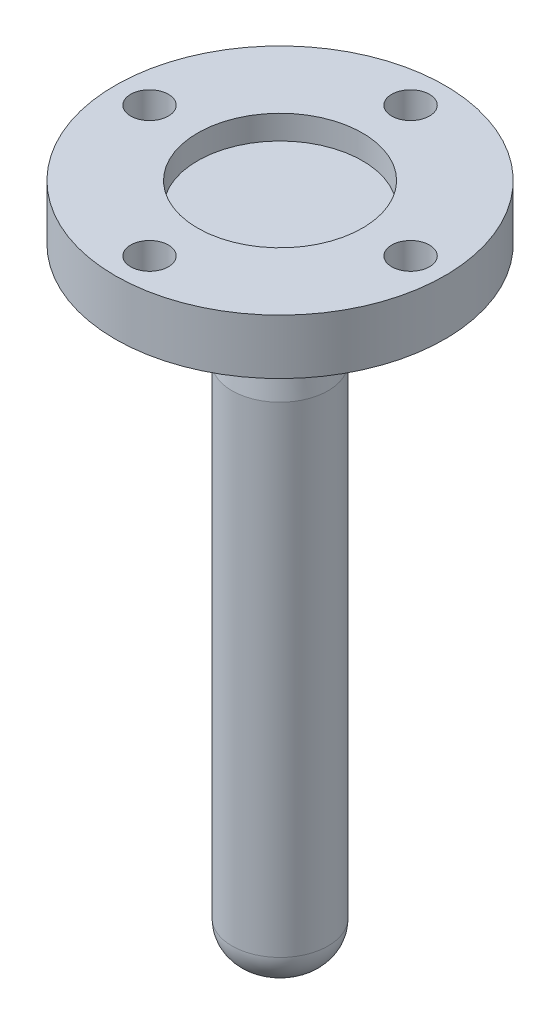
from build123d import *

# Parameters (mm, degrees)
SKETCH1_R           = 24
BOSS_EXTRUDE1_DEPTH = 8
FILLET1_R           = 5
SKETCH12_R          = 12
CUT_EXTRUDE1_DEPTH  = 3.5
SKETCH13_R          = 2.75
CUT_EXTRUDE2_DEPTH  = 5.5


with BuildPart() as part:
    # Sketch1 → Boss-Extrude1 (new body)
    with BuildSketch(Plane(origin=(0, 0, 0), x_dir=(1, 0, 0), z_dir=(0, 1, 0))):
        with Locations(Location((0, 0, 0), (0, 0, 270))):
            Circle(SKETCH1_R)
    extrude(amount=BOSS_EXTRUDE1_DEPTH)

    # Sketch11 → Revolve1 (revolve)
    with BuildSketch(Plane.XY, mode=Mode.PRIVATE) as revolve1_sk:
        Polygon((0, 0), (0, -90), (7, -90), (7, -15), (5, 0), align=None)
    revolve(revolve1_sk.sketch.rotate(Axis((0, 0, 0), (0, -1, 0)), 180), axis=Axis((0, 0, 0), (0, -1, 0)))

    # Fillet1
    fillet1_edges = [part.edges().sort_by_distance(p)[0] for p in [
        (7, -90, 0),
    ]]
    fillet(fillet1_edges, radius=FILLET1_R)

    # Sketch12 → Cut-Extrude1 (cut)
    with BuildSketch(Plane(origin=(0, 8, 0), x_dir=(1, 0, 0), z_dir=(0, 1, 0))):
        with Locations(Location((0, 0, 0), (0, 0, 270))):
            Circle(SKETCH12_R)
    extrude(amount=-CUT_EXTRUDE1_DEPTH, mode=Mode.SUBTRACT)

    # Sketch13 → Cut-Extrude2 (cut)
    with BuildSketch(Plane(origin=(0, 8, 0), x_dir=(1, 0, 0), z_dir=(0, 1, 0))):
        with Locations(Location((-19, 0, 0), (0, 0, 270))):
            Circle(SKETCH13_R)
        with Locations(Location((0, 19, 0), (0, 0, 270))):
            Circle(SKETCH13_R)
        with Locations(Location((19, 0, 0), (0, 0, 270))):
            Circle(SKETCH13_R)
        with Locations(Location((0, -19, 0), (0, 0, 270))):
            Circle(SKETCH13_R)
    extrude(amount=-CUT_EXTRUDE2_DEPTH, mode=Mode.SUBTRACT)


solid = part.part
